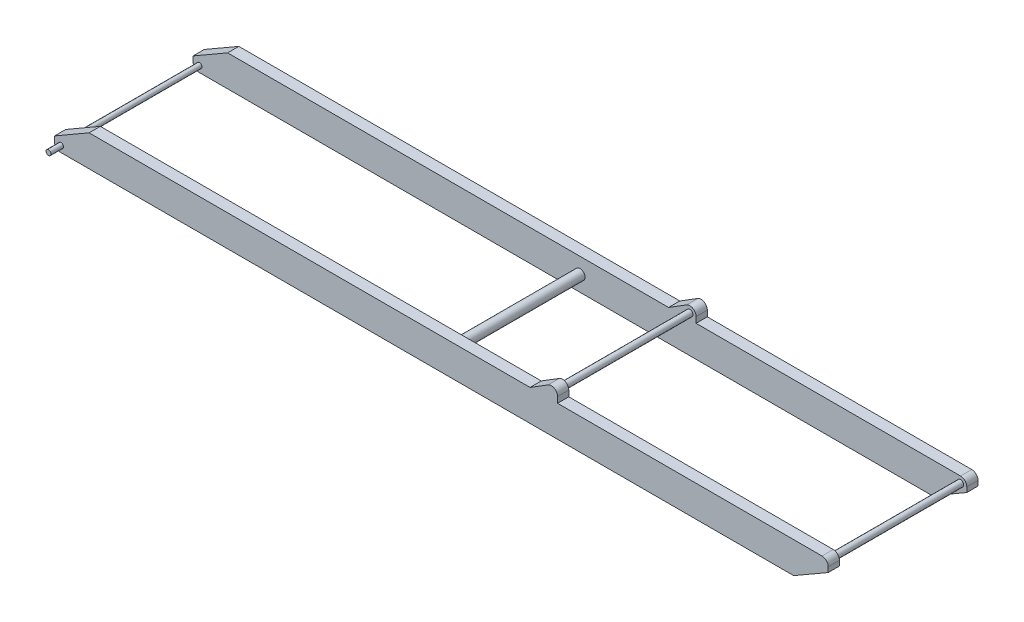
from build123d import *

# Parameters (mm, degrees)
ESQUISSE1_R             = 25
ESQUISSE1_R_2           = 20
EXTRUSION1_DEPTH        = 600
ESQUISSE2_W             = 6614.753342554
ESQUISSE2_H             = 1020
ENL_V_MAT_EXTRU_1_DEPTH = 6185.254199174
ESQUISSE3_R             = 20
EXTRUSION2_DEPTH        = 700
ESQUISSE4_R             = 25
EXTRUSION3_DEPTH        = 600
ESQUISSE5_R             = 40
EXTRUSION4_DEPTH        = 600
ESQUISSE6_R             = 25
EXTRUSION5_DEPTH        = 600
EXTRUSION6_DEPTH        = 90
EXTRUSION7_DEPTH        = 90


with BuildPart() as part:
    # Esquisse1 → Extrusion1 (new, symmetric)
    with BuildSketch(Plane.XY):
        with BuildLine():
            Line((50, 0), (50, -40))
            Line((50, -40), (-227.128129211, -200))
            Line((-227.128129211, -200), (-6100, -200))
            ThreePointArc((-6100, -200), (-6135.355339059, -185.355339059), (-6150, -150))
            Line((-6150, -150), (-6150, -110))
            Line((-6150, -110), (-5872.871870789, 50))
            Line((-5872.871870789, 50), (0, 50))
            ThreePointArc((0, 50), (35.355339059, 35.355339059), (50, 0))
        make_face()
        Circle(ESQUISSE1_R, mode=Mode.SUBTRACT)
        with Locations((-6098.155458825, -150)):
            Circle(ESQUISSE1_R_2, mode=Mode.SUBTRACT)
    extrude(amount=EXTRUSION1_DEPTH, both=True)

    # Esquisse2 → Enl_v. mat.-Extru.1 (cut, through all)
    with BuildSketch(Plane(origin=(0, 50, 0), x_dir=(1, 0, 0), z_dir=(0, 1, 0))):
        with Locations((-3095.379898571, 0)):
            Rectangle(ESQUISSE2_W, ESQUISSE2_H)
    extrude(amount=-ENL_V_MAT_EXTRU_1_DEPTH, mode=Mode.SUBTRACT)


with BuildPart() as enl_v_mat_extru_1_piece_1:
    # of the separate pieces the step leaves, piece 1, a body of its own (enl_v_mat_extru_1_pieces)
    add(part.part.solids().sort_by_distance((50, 0, -600))[0])



with BuildPart() as enl_v_mat_extru_1_piece_2:
    # of the separate pieces the step leaves, piece 2, a body of its own (enl_v_mat_extru_1_pieces)
    add(part.part.solids().sort_by_distance((50, 0, 510))[0])


with BuildPart() as enl_v_mat_extru_1_piece_1_1:
    add(enl_v_mat_extru_1_piece_1.part)

    add(enl_v_mat_extru_1_piece_2.part)  # Extrusion2 merges Enl_v. mat.-Extru.1 piece 2
    # Esquisse3 → Extrusion2 (add, symmetric)
    with BuildSketch(Plane.XY):
        with Locations(Location((-6098.155458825, -150, 0), (0, 0, 180))):
            Circle(ESQUISSE3_R)
    extrude(amount=EXTRUSION2_DEPTH, both=True)

    # Esquisse4 → Extrusion3 (add, symmetric)
    with BuildSketch(Plane.XY):
        with Locations(Location((0, 0, 0), (0, 0, 180))):
            Circle(ESQUISSE4_R)
    extrude(amount=EXTRUSION3_DEPTH, both=True)

    # Esquisse5 → Extrusion4 (add, symmetric)
    with BuildSketch(Plane.XY):
        with Locations(Location((-3049.077729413, -75, 0), (0, 0, 180))):
            Circle(ESQUISSE5_R)
    extrude(amount=EXTRUSION4_DEPTH, both=True)



with BuildPart() as body_2:
    # Esquisse6 → Extrusion5 (new, symmetric)
    with BuildSketch(Plane.XY):
        with Locations(Location((-2169.082193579, 97, 0), (0, 0, 180))):
            Circle(ESQUISSE6_R)
    extrude(amount=EXTRUSION5_DEPTH, both=True)


with BuildPart() as enl_v_mat_extru_1_piece_1_2:
    add(enl_v_mat_extru_1_piece_1_1.part)

    add(body_2.part)  # Extrusion6 merges body 2
    # Esquisse7 → Extrusion6 (add)
    with BuildSketch(Plane.XY.offset(600)):
        with BuildLine():
            Line((-2119.082193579, 97), (-2119.082193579, 47))
            Line((-2119.082193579, 47), (-2344.184612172, 47))
            Line((-2344.184612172, 47), (-2195.484167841, 139.46099098))
            ThreePointArc((-2195.484167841, 139.46099098), (-2144.793293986, 140.704111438), (-2119.082193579, 97))
        make_face()
    extrude(amount=-EXTRUSION6_DEPTH)

    # Esquisse8 → Extrusion7 (add)
    with BuildSketch(Plane(origin=(0, 0, -600), x_dir=(-1, 0, 0), z_dir=(0, 0, -1))):
        with BuildLine():
            Line((2119.082193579, 97), (2119.082193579, 50))
            Line((2119.082193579, 50), (0, 50))
            ThreePointArc((0, 50), (-35.355339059, 35.355339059), (-50, 0))
            Line((-50, 0), (-50, -40))
            Line((-50, -40), (227.128129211, -200))
            Line((227.128129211, -200), (6100, -200))
            ThreePointArc((6100, -200), (6135.355339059, -185.355339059), (6150, -150))
            Line((6150, -150), (6150, -110))
            Line((6150, -110), (5872.871870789, 50))
            Line((5872.871870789, 50), (2339.359860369, 50))
            Line((2339.359860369, 50), (2195.484167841, 139.46099098))
            ThreePointArc((2195.484167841, 139.46099098), (2144.793293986, 140.704111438), (2119.082193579, 97))
        make_face()
    extrude(amount=-EXTRUSION7_DEPTH)


solid = enl_v_mat_extru_1_piece_1_2.part
